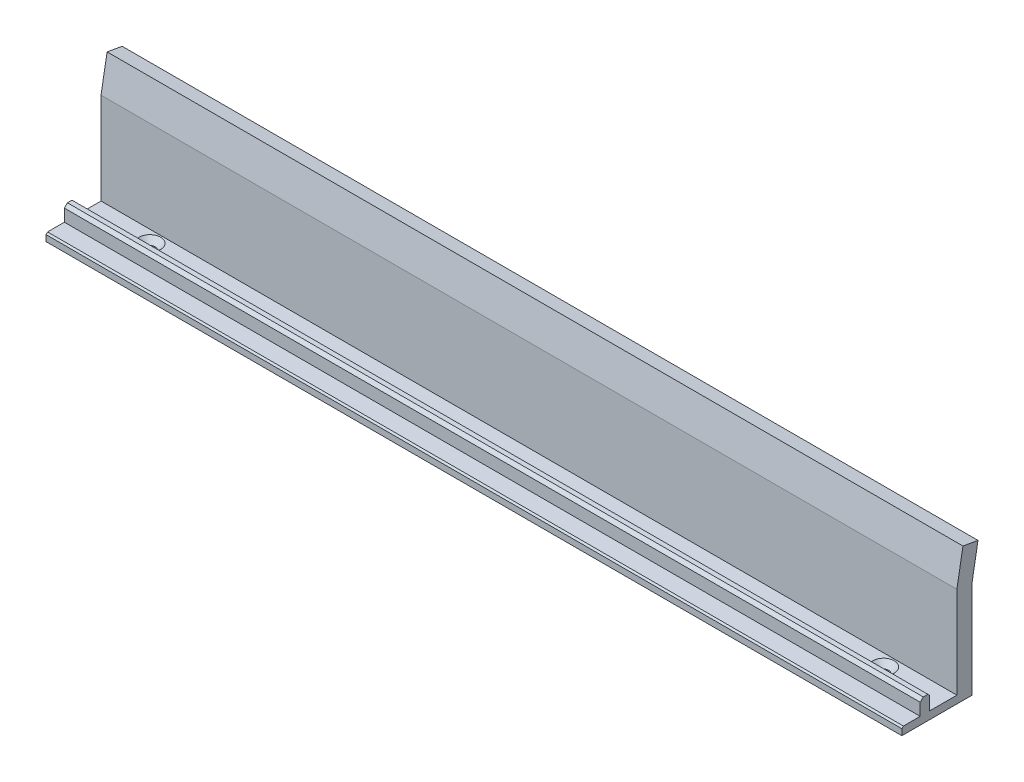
from build123d import *

# Parameters (mm, degrees)
SKIZZE1_W                                   = 280
SKIZZE1_H                                   = 23
AUFSATZ_LINEAR_AUSTRAGEN1_DEPTH             = 3
SKIZZE2_W                                   = 280
SKIZZE2_H                                   = 3
AUFSATZ_LINEAR_AUSTRAGEN2_DEPTH             = 5
FASE1_SIZE                                  = 0.5
FASE2_SIZE                                  = 1
FORMSENKUNG_F_R_M3_SENKSCHRAUBE_MIT_2_COUNT = 2
FORMSENKUNG_F_R_M3_SENKSCHRAUBE_MIT_2_PITCH = 240
AUFSATZ_LINEAR_AUSTRAGEN3_DEPTH             = 280


with BuildPart() as part:
    # Skizze1 → Aufsatz-Linear austragen1 (new body)
    with BuildSketch(Plane(origin=(0, 0, 0), x_dir=(1, 0, 0), z_dir=(0, 1, 0))):
        Rectangle(SKIZZE1_W, SKIZZE1_H)
    extrude(amount=AUFSATZ_LINEAR_AUSTRAGEN1_DEPTH)

    # Skizze2 → Aufsatz-Linear austragen2 (add)
    with BuildSketch(Plane(origin=(0, 3, 0), x_dir=(1, 0, 0), z_dir=(0, 1, 0))):
        with Locations((0, -4)):
            Rectangle(SKIZZE2_W, SKIZZE2_H)
    extrude(amount=AUFSATZ_LINEAR_AUSTRAGEN2_DEPTH)

    # Fase1
    fase1_edges = [part.edges().sort_by_distance(p)[0] for p in [
        (0, 3, 11.5),
        (0, 8, 2.5),
        (0, 0, 11.5),
        (-140, 0, 0),
        (0, 0, -11.5),
        (140, 0, 0),
    ]]
    chamfer(fase1_edges, length=FASE1_SIZE)

    # Fase2
    fase2_edges = [part.edges().sort_by_distance(p)[0] for p in [
        (0, 8, 5.5),
    ]]
    chamfer(fase2_edges, length=FASE2_SIZE)

    # Skizze4 → Formsenkung f_r M3 Senkschraube mit Inne (revolve, cut)
    with BuildSketch(Plane(origin=(120, 3, -2.5), x_dir=(0, 0, 1), z_dir=(1, 0, 0))):
        Polygon((0, 0), (0, 3), (1.7, 3), (1.7, 1.8), (3.5, 0), align=None)
    formsenkung_f_r_m3_senkschraube_mit_inne = revolve(axis=Axis((120, 9.35, -2.5), (0, -1, 0)), mode=Mode.SUBTRACT)

    # Formsenkung f_r M3 Senkschraube mit  2: Formsenkung f_r M3 Senkschraube mit Inne ×2
    with Locations(*[(-i * FORMSENKUNG_F_R_M3_SENKSCHRAUBE_MIT_2_PITCH, 0, 0) for i in range(1, FORMSENKUNG_F_R_M3_SENKSCHRAUBE_MIT_2_COUNT)]):
        add(formsenkung_f_r_m3_senkschraube_mit_inne, mode=Mode.SUBTRACT)

    # Skizze5 → Aufsatz-Linear austragen3 (add)
    with BuildSketch(Plane(origin=(140, 0, 0), x_dir=(0, 0, -1), z_dir=(1, 0, 0))):
        Polygon((11.5, 3), (11.5, 32.562556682), (13.410129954, 43.395441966), (8.486091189, 44.263682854), (6.5, 33), (6.5, 3), align=None)
    extrude(amount=-AUFSATZ_LINEAR_AUSTRAGEN3_DEPTH)


solid = part.part
